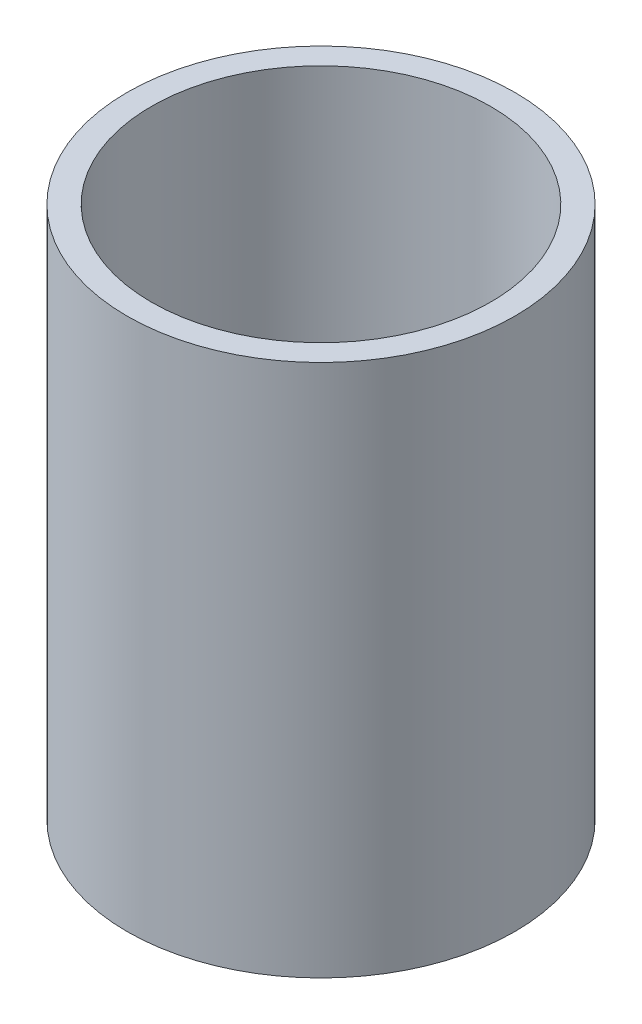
ISO-10303-21;
HEADER;
FILE_DESCRIPTION(('STEP AP214'),'2;1');
FILE_NAME('part.step','',(''),(''),'','','');
FILE_SCHEMA(('AUTOMOTIVE_DESIGN { 1 0 10303 214 1 1 1 1 }'));
ENDSEC;
DATA;
#1=APPLICATION_CONTEXT('core data for automotive mechanical design processes');
#2=APPLICATION_PROTOCOL_DEFINITION('international standard','automotive_design',2000,#1);
#3=PRODUCT_CONTEXT('',#1,'mechanical');
#4=PRODUCT('Part','Part','',(#3));
#5=PRODUCT_RELATED_PRODUCT_CATEGORY('part','',(#4));
#6=PRODUCT_DEFINITION_FORMATION('','',#4);
#7=PRODUCT_DEFINITION_CONTEXT('part definition',#1,'design');
#8=PRODUCT_DEFINITION('design','',#6,#7);
#9=PRODUCT_DEFINITION_SHAPE('','',#8);
#10=(LENGTH_UNIT() NAMED_UNIT(*) SI_UNIT(.MILLI.,.METRE.));
#11=(NAMED_UNIT(*) PLANE_ANGLE_UNIT() SI_UNIT($,.RADIAN.));
#12=(NAMED_UNIT(*) SI_UNIT($,.STERADIAN.) SOLID_ANGLE_UNIT());
#13=UNCERTAINTY_MEASURE_WITH_UNIT(LENGTH_MEASURE(1.E-05),#10,'distance_accuracy_value','');
#14=(GEOMETRIC_REPRESENTATION_CONTEXT(3) GLOBAL_UNCERTAINTY_ASSIGNED_CONTEXT((#13)) GLOBAL_UNIT_ASSIGNED_CONTEXT((#10,
#11,#12)) REPRESENTATION_CONTEXT('',''));
#15=CARTESIAN_POINT('',(0.,0.,0.));
#16=DIRECTION('',(0.,0.,1.));
#17=DIRECTION('',(1.,0.,0.));
#18=AXIS2_PLACEMENT_3D('',#15,#16,#17);
#19=CARTESIAN_POINT('',(0.,110.,0.));
#20=DIRECTION('',(0.,1.,0.));
#21=DIRECTION('',(0.,0.,1.));
#22=AXIS2_PLACEMENT_3D('',#19,#20,#21);
#23=PLANE('',#22);
#24=CARTESIAN_POINT('',(0.,110.,0.));
#25=DIRECTION('',(0.,1.,0.));
#26=DIRECTION('',(0.,0.,1.));
#27=AXIS2_PLACEMENT_3D('',#24,#25,#26);
#28=CIRCLE('',#27,40.);
#29=CARTESIAN_POINT('',(0.,110.,40.));
#30=VERTEX_POINT('',#29);
#31=EDGE_CURVE('E10',#30,#30,#28,.T.);
#32=ORIENTED_EDGE('',*,*,#31,.T.);
#33=EDGE_LOOP('',(#32));
#34=FACE_BOUND('',#33,.T.);
#35=CARTESIAN_POINT('',(0.,110.,0.));
#36=DIRECTION('',(0.,1.,0.));
#37=DIRECTION('',(0.,0.,1.));
#38=AXIS2_PLACEMENT_3D('',#35,#36,#37);
#39=CIRCLE('',#38,35.);
#40=CARTESIAN_POINT('',(0.,110.,35.));
#41=VERTEX_POINT('',#40);
#42=EDGE_CURVE('E45',#41,#41,#39,.T.);
#43=ORIENTED_EDGE('',*,*,#42,.F.);
#44=EDGE_LOOP('',(#43));
#45=FACE_BOUND('',#44,.T.);
#46=ADVANCED_FACE('F34',(#34,#45),#23,.T.);
#47=CARTESIAN_POINT('',(0.,0.,0.));
#48=DIRECTION('',(0.,1.,0.));
#49=DIRECTION('',(0.,0.,1.));
#50=AXIS2_PLACEMENT_3D('',#47,#48,#49);
#51=PLANE('',#50);
#52=CARTESIAN_POINT('',(0.,0.,0.));
#53=DIRECTION('',(0.,1.,0.));
#54=DIRECTION('',(0.,0.,1.));
#55=AXIS2_PLACEMENT_3D('',#52,#53,#54);
#56=CIRCLE('',#55,40.);
#57=CARTESIAN_POINT('',(0.,0.,40.));
#58=VERTEX_POINT('',#57);
#59=EDGE_CURVE('E38',#58,#58,#56,.T.);
#60=ORIENTED_EDGE('',*,*,#59,.F.);
#61=EDGE_LOOP('',(#60));
#62=FACE_BOUND('',#61,.T.);
#63=CARTESIAN_POINT('',(0.,0.,0.));
#64=DIRECTION('',(0.,1.,0.));
#65=DIRECTION('',(0.,0.,1.));
#66=AXIS2_PLACEMENT_3D('',#63,#64,#65);
#67=CIRCLE('',#66,35.);
#68=CARTESIAN_POINT('',(0.,0.,35.));
#69=VERTEX_POINT('',#68);
#70=EDGE_CURVE('E47',#69,#69,#67,.T.);
#71=ORIENTED_EDGE('',*,*,#70,.T.);
#72=EDGE_LOOP('',(#71));
#73=FACE_BOUND('',#72,.T.);
#74=ADVANCED_FACE('F57',(#62,#73),#51,.F.);
#75=CARTESIAN_POINT('',(0.,110.,0.));
#76=DIRECTION('',(0.,-1.,0.));
#77=DIRECTION('',(0.,0.,-1.));
#78=AXIS2_PLACEMENT_3D('',#75,#76,#77);
#79=CYLINDRICAL_SURFACE('',#78,40.);
#80=ORIENTED_EDGE('',*,*,#31,.F.);
#81=EDGE_LOOP('',(#80));
#82=FACE_BOUND('',#81,.T.);
#83=ORIENTED_EDGE('',*,*,#59,.T.);
#84=EDGE_LOOP('',(#83));
#85=FACE_BOUND('',#84,.T.);
#86=ADVANCED_FACE('F36',(#82,#85),#79,.T.);
#87=CARTESIAN_POINT('',(0.,110.,0.));
#88=DIRECTION('',(0.,-1.,0.));
#89=DIRECTION('',(0.,0.,-1.));
#90=AXIS2_PLACEMENT_3D('',#87,#88,#89);
#91=CYLINDRICAL_SURFACE('',#90,35.);
#92=ORIENTED_EDGE('',*,*,#42,.T.);
#93=EDGE_LOOP('',(#92));
#94=FACE_BOUND('',#93,.T.);
#95=ORIENTED_EDGE('',*,*,#70,.F.);
#96=EDGE_LOOP('',(#95));
#97=FACE_BOUND('',#96,.T.);
#98=ADVANCED_FACE('F53',(#94,#97),#91,.F.);
#99=CLOSED_SHELL('',(#46,#74,#86,#98));
#100=MANIFOLD_SOLID_BREP('B2',#99);
#101=ADVANCED_BREP_SHAPE_REPRESENTATION('',(#18,#100),#14);
#102=SHAPE_DEFINITION_REPRESENTATION(#9,#101);
ENDSEC;
END-ISO-10303-21;
